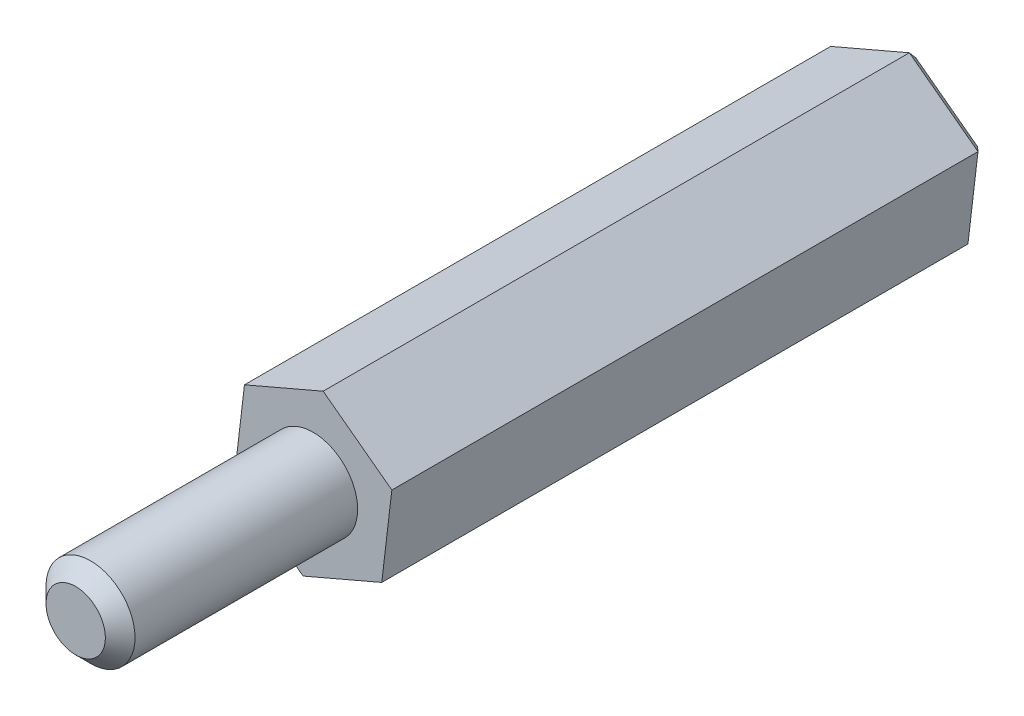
ISO-10303-21;
HEADER;
FILE_DESCRIPTION(('STEP AP214'),'2;1');
FILE_NAME('part.step','',(''),(''),'','','');
FILE_SCHEMA(('AUTOMOTIVE_DESIGN { 1 0 10303 214 1 1 1 1 }'));
ENDSEC;
DATA;
#1=APPLICATION_CONTEXT('core data for automotive mechanical design processes');
#2=APPLICATION_PROTOCOL_DEFINITION('international standard','automotive_design',2000,#1);
#3=PRODUCT_CONTEXT('',#1,'mechanical');
#4=PRODUCT('Part','Part','',(#3));
#5=PRODUCT_RELATED_PRODUCT_CATEGORY('part','',(#4));
#6=PRODUCT_DEFINITION_FORMATION('','',#4);
#7=PRODUCT_DEFINITION_CONTEXT('part definition',#1,'design');
#8=PRODUCT_DEFINITION('design','',#6,#7);
#9=PRODUCT_DEFINITION_SHAPE('','',#8);
#10=(LENGTH_UNIT() NAMED_UNIT(*) SI_UNIT(.MILLI.,.METRE.));
#11=(NAMED_UNIT(*) PLANE_ANGLE_UNIT() SI_UNIT($,.RADIAN.));
#12=(NAMED_UNIT(*) SI_UNIT($,.STERADIAN.) SOLID_ANGLE_UNIT());
#13=UNCERTAINTY_MEASURE_WITH_UNIT(LENGTH_MEASURE(1.E-05),#10,'distance_accuracy_value','');
#14=(GEOMETRIC_REPRESENTATION_CONTEXT(3) GLOBAL_UNCERTAINTY_ASSIGNED_CONTEXT((#13)) GLOBAL_UNIT_ASSIGNED_CONTEXT((#10,
#11,#12)) REPRESENTATION_CONTEXT('',''));
#15=CARTESIAN_POINT('',(0.,0.,0.));
#16=DIRECTION('',(0.,0.,1.));
#17=DIRECTION('',(1.,0.,0.));
#18=AXIS2_PLACEMENT_3D('',#15,#16,#17);
#19=CARTESIAN_POINT('',(0.,0.,20.));
#20=DIRECTION('',(0.,0.,1.));
#21=DIRECTION('',(1.,0.,0.));
#22=AXIS2_PLACEMENT_3D('',#19,#20,#21);
#23=PLANE('',#22);
#24=DIRECTION('',(-0.117457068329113,-0.993077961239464,0.));
#25=VECTOR('',#24,1.);
#26=CARTESIAN_POINT('',(-2.31316022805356,1.7270272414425,20.));
#27=LINE('',#26,#25);
#28=CARTESIAN_POINT('',(-2.31316022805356,1.7270272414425,20.));
#29=VERTEX_POINT('',#28);
#30=CARTESIAN_POINT('',(-2.65222957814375,-1.13974189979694,20.));
#31=VERTEX_POINT('',#30);
#32=EDGE_CURVE('E119',#29,#31,#27,.T.);
#33=ORIENTED_EDGE('',*,*,#32,.T.);
#34=DIRECTION('',(0.801302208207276,-0.59825978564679,0.));
#35=VECTOR('',#34,1.);
#36=CARTESIAN_POINT('',(-2.65222957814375,-1.13974189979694,20.));
#37=LINE('',#36,#35);
#38=CARTESIAN_POINT('',(-0.339069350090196,-2.86676914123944,20.));
#39=VERTEX_POINT('',#38);
#40=EDGE_CURVE('E107',#31,#39,#37,.T.);
#41=ORIENTED_EDGE('',*,*,#40,.T.);
#42=DIRECTION('',(0.918759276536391,0.394818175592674,0.));
#43=VECTOR('',#42,1.);
#44=CARTESIAN_POINT('',(-0.339069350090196,-2.86676914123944,20.));
#45=LINE('',#44,#43);
#46=CARTESIAN_POINT('',(2.31316022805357,-1.7270272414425,20.));
#47=VERTEX_POINT('',#46);
#48=EDGE_CURVE('E118',#39,#47,#45,.T.);
#49=ORIENTED_EDGE('',*,*,#48,.T.);
#50=DIRECTION('',(0.117457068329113,0.993077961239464,0.));
#51=VECTOR('',#50,1.);
#52=CARTESIAN_POINT('',(2.31316022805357,-1.7270272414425,20.));
#53=LINE('',#52,#51);
#54=CARTESIAN_POINT('',(2.65222957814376,1.13974189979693,20.));
#55=VERTEX_POINT('',#54);
#56=EDGE_CURVE('E196',#47,#55,#53,.T.);
#57=ORIENTED_EDGE('',*,*,#56,.T.);
#58=DIRECTION('',(-0.801302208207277,0.598259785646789,0.));
#59=VECTOR('',#58,1.);
#60=CARTESIAN_POINT('',(2.65222957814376,1.13974189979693,20.));
#61=LINE('',#60,#59);
#62=CARTESIAN_POINT('',(0.339069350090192,2.86676914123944,20.));
#63=VERTEX_POINT('',#62);
#64=EDGE_CURVE('E198',#55,#63,#61,.T.);
#65=ORIENTED_EDGE('',*,*,#64,.T.);
#66=DIRECTION('',(-0.918759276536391,-0.394818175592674,0.));
#67=VECTOR('',#66,1.);
#68=CARTESIAN_POINT('',(0.339069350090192,2.86676914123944,20.));
#69=LINE('',#68,#67);
#70=EDGE_CURVE('E124',#63,#29,#69,.T.);
#71=ORIENTED_EDGE('',*,*,#70,.T.);
#72=EDGE_LOOP('',(#33,#41,#49,#57,#65,#71));
#73=FACE_BOUND('',#72,.T.);
#74=CARTESIAN_POINT('',(0.,0.,20.));
#75=DIRECTION('',(0.,0.,1.));
#76=DIRECTION('',(1.,0.,0.));
#77=AXIS2_PLACEMENT_3D('',#74,#75,#76);
#78=CIRCLE('',#77,1.5);
#79=CARTESIAN_POINT('',(1.5,0.,20.));
#80=VERTEX_POINT('',#79);
#81=EDGE_CURVE('E126',#80,#80,#78,.T.);
#82=ORIENTED_EDGE('',*,*,#81,.F.);
#83=EDGE_LOOP('',(#82));
#84=FACE_BOUND('',#83,.T.);
#85=ADVANCED_FACE('F33',(#73,#84),#23,.T.);
#86=CARTESIAN_POINT('',(-2.31316022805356,1.7270272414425,20.));
#87=DIRECTION('',(0.993077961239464,-0.117457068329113,0.));
#88=DIRECTION('',(0.117457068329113,0.993077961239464,0.));
#89=AXIS2_PLACEMENT_3D('',#86,#87,#88);
#90=PLANE('',#89);
#91=DIRECTION('',(0.,0.,-1.));
#92=VECTOR('',#91,1.);
#93=CARTESIAN_POINT('',(-2.31316022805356,1.7270272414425,20.));
#94=LINE('',#93,#92);
#95=CARTESIAN_POINT('',(-2.31316022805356,1.7270272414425,0.249999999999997));
#96=VERTEX_POINT('',#95);
#97=EDGE_CURVE('E201',#29,#96,#94,.T.);
#98=ORIENTED_EDGE('',*,*,#97,.T.);
#99=DIRECTION('',(-0.117457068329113,-0.993077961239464,0.));
#100=VECTOR('',#99,1.);
#101=CARTESIAN_POINT('',(-2.31316022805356,1.7270272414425,0.249999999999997));
#102=LINE('',#101,#100);
#103=CARTESIAN_POINT('',(-2.65222957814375,-1.13974189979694,0.249999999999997));
#104=VERTEX_POINT('',#103);
#105=EDGE_CURVE('E11',#96,#104,#102,.T.);
#106=ORIENTED_EDGE('',*,*,#105,.T.);
#107=DIRECTION('',(0.,0.,-1.));
#108=VECTOR('',#107,1.);
#109=CARTESIAN_POINT('',(-2.65222957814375,-1.13974189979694,20.));
#110=LINE('',#109,#108);
#111=EDGE_CURVE('E112',#31,#104,#110,.T.);
#112=ORIENTED_EDGE('',*,*,#111,.F.);
#113=ORIENTED_EDGE('',*,*,#32,.F.);
#114=EDGE_LOOP('',(#98,#106,#112,#113));
#115=FACE_BOUND('',#114,.T.);
#116=ADVANCED_FACE('F128',(#115),#90,.F.);
#117=CARTESIAN_POINT('',(-2.65222957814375,-1.13974189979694,20.));
#118=DIRECTION('',(0.59825978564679,0.801302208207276,0.));
#119=DIRECTION('',(-0.801302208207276,0.59825978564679,0.));
#120=AXIS2_PLACEMENT_3D('',#117,#118,#119);
#121=PLANE('',#120);
#122=ORIENTED_EDGE('',*,*,#111,.T.);
#123=DIRECTION('',(0.801302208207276,-0.59825978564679,0.));
#124=VECTOR('',#123,1.);
#125=CARTESIAN_POINT('',(-2.65222957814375,-1.13974189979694,0.249999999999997));
#126=LINE('',#125,#124);
#127=CARTESIAN_POINT('',(-0.339069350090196,-2.86676914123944,0.249999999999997));
#128=VERTEX_POINT('',#127);
#129=EDGE_CURVE('E147',#104,#128,#126,.T.);
#130=ORIENTED_EDGE('',*,*,#129,.T.);
#131=DIRECTION('',(0.,0.,-1.));
#132=VECTOR('',#131,1.);
#133=CARTESIAN_POINT('',(-0.339069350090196,-2.86676914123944,20.));
#134=LINE('',#133,#132);
#135=EDGE_CURVE('E115',#39,#128,#134,.T.);
#136=ORIENTED_EDGE('',*,*,#135,.F.);
#137=ORIENTED_EDGE('',*,*,#40,.F.);
#138=EDGE_LOOP('',(#122,#130,#136,#137));
#139=FACE_BOUND('',#138,.T.);
#140=ADVANCED_FACE('F109',(#139),#121,.F.);
#141=CARTESIAN_POINT('',(-0.339069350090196,-2.86676914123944,20.));
#142=DIRECTION('',(-0.394818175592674,0.918759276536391,0.));
#143=DIRECTION('',(-0.918759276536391,-0.394818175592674,0.));
#144=AXIS2_PLACEMENT_3D('',#141,#142,#143);
#145=PLANE('',#144);
#146=ORIENTED_EDGE('',*,*,#135,.T.);
#147=DIRECTION('',(0.918759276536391,0.394818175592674,0.));
#148=VECTOR('',#147,1.);
#149=CARTESIAN_POINT('',(-0.339069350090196,-2.86676914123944,0.249999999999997));
#150=LINE('',#149,#148);
#151=CARTESIAN_POINT('',(2.31316022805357,-1.7270272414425,0.249999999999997));
#152=VERTEX_POINT('',#151);
#153=EDGE_CURVE('E162',#128,#152,#150,.T.);
#154=ORIENTED_EDGE('',*,*,#153,.T.);
#155=DIRECTION('',(0.,0.,-1.));
#156=VECTOR('',#155,1.);
#157=CARTESIAN_POINT('',(2.31316022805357,-1.7270272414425,20.));
#158=LINE('',#157,#156);
#159=EDGE_CURVE('E135',#47,#152,#158,.T.);
#160=ORIENTED_EDGE('',*,*,#159,.F.);
#161=ORIENTED_EDGE('',*,*,#48,.F.);
#162=EDGE_LOOP('',(#146,#154,#160,#161));
#163=FACE_BOUND('',#162,.T.);
#164=ADVANCED_FACE('F261',(#163),#145,.F.);
#165=CARTESIAN_POINT('',(2.31316022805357,-1.7270272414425,20.));
#166=DIRECTION('',(-0.993077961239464,0.117457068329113,0.));
#167=DIRECTION('',(-0.117457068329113,-0.993077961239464,0.));
#168=AXIS2_PLACEMENT_3D('',#165,#166,#167);
#169=PLANE('',#168);
#170=ORIENTED_EDGE('',*,*,#159,.T.);
#171=DIRECTION('',(0.117457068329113,0.993077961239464,0.));
#172=VECTOR('',#171,1.);
#173=CARTESIAN_POINT('',(2.31316022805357,-1.7270272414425,0.249999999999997));
#174=LINE('',#173,#172);
#175=CARTESIAN_POINT('',(2.65222957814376,1.13974189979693,0.249999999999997));
#176=VERTEX_POINT('',#175);
#177=EDGE_CURVE('E164',#152,#176,#174,.T.);
#178=ORIENTED_EDGE('',*,*,#177,.T.);
#179=DIRECTION('',(0.,0.,-1.));
#180=VECTOR('',#179,1.);
#181=CARTESIAN_POINT('',(2.65222957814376,1.13974189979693,20.));
#182=LINE('',#181,#180);
#183=EDGE_CURVE('E205',#55,#176,#182,.T.);
#184=ORIENTED_EDGE('',*,*,#183,.F.);
#185=ORIENTED_EDGE('',*,*,#56,.F.);
#186=EDGE_LOOP('',(#170,#178,#184,#185));
#187=FACE_BOUND('',#186,.T.);
#188=ADVANCED_FACE('F210',(#187),#169,.F.);
#189=CARTESIAN_POINT('',(2.65222957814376,1.13974189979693,20.));
#190=DIRECTION('',(-0.598259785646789,-0.801302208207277,0.));
#191=DIRECTION('',(0.801302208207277,-0.598259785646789,0.));
#192=AXIS2_PLACEMENT_3D('',#189,#190,#191);
#193=PLANE('',#192);
#194=ORIENTED_EDGE('',*,*,#183,.T.);
#195=DIRECTION('',(-0.801302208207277,0.598259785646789,0.));
#196=VECTOR('',#195,1.);
#197=CARTESIAN_POINT('',(2.65222957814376,1.13974189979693,0.249999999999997));
#198=LINE('',#197,#196);
#199=CARTESIAN_POINT('',(0.339069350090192,2.86676914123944,0.249999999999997));
#200=VERTEX_POINT('',#199);
#201=EDGE_CURVE('E57',#176,#200,#198,.T.);
#202=ORIENTED_EDGE('',*,*,#201,.T.);
#203=DIRECTION('',(0.,0.,-1.));
#204=VECTOR('',#203,1.);
#205=CARTESIAN_POINT('',(0.339069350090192,2.86676914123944,20.));
#206=LINE('',#205,#204);
#207=EDGE_CURVE('E203',#63,#200,#206,.T.);
#208=ORIENTED_EDGE('',*,*,#207,.F.);
#209=ORIENTED_EDGE('',*,*,#64,.F.);
#210=EDGE_LOOP('',(#194,#202,#208,#209));
#211=FACE_BOUND('',#210,.T.);
#212=ADVANCED_FACE('F256',(#211),#193,.F.);
#213=CARTESIAN_POINT('',(0.339069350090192,2.86676914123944,20.));
#214=DIRECTION('',(0.394818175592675,-0.918759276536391,0.));
#215=DIRECTION('',(0.918759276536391,0.394818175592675,0.));
#216=AXIS2_PLACEMENT_3D('',#213,#214,#215);
#217=PLANE('',#216);
#218=ORIENTED_EDGE('',*,*,#207,.T.);
#219=DIRECTION('',(-0.918759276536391,-0.394818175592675,0.));
#220=VECTOR('',#219,1.);
#221=CARTESIAN_POINT('',(0.339069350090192,2.86676914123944,0.249999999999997));
#222=LINE('',#221,#220);
#223=EDGE_CURVE('E42',#200,#96,#222,.T.);
#224=ORIENTED_EDGE('',*,*,#223,.T.);
#225=ORIENTED_EDGE('',*,*,#97,.F.);
#226=ORIENTED_EDGE('',*,*,#70,.F.);
#227=EDGE_LOOP('',(#218,#224,#225,#226));
#228=FACE_BOUND('',#227,.T.);
#229=ADVANCED_FACE('F253',(#228),#217,.F.);
#230=CARTESIAN_POINT('',(0.,0.,0.));
#231=DIRECTION('',(0.,0.,1.));
#232=DIRECTION('',(1.,0.,0.));
#233=AXIS2_PLACEMENT_3D('',#230,#231,#232);
#234=PLANE('',#233);
#235=DIRECTION('',(-0.918759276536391,-0.394818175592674,0.));
#236=VECTOR('',#235,1.);
#237=CARTESIAN_POINT('',(0.888340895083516,-2.06720837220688,0.));
#238=LINE('',#237,#236);
#239=CARTESIAN_POINT('',(2.08184420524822,-1.55432451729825,0.));
#240=VERTEX_POINT('',#239);
#241=CARTESIAN_POINT('',(-0.305162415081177,-2.5800922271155,0.));
#242=VERTEX_POINT('',#241);
#243=EDGE_CURVE('E157',#240,#242,#238,.T.);
#244=ORIENTED_EDGE('',*,*,#243,.T.);
#245=DIRECTION('',(-0.801302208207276,0.59825978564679,0.));
#246=VECTOR('',#245,1.);
#247=CARTESIAN_POINT('',(-1.34608451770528,-1.80292996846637,0.));
#248=LINE('',#247,#246);
#249=CARTESIAN_POINT('',(-2.38700662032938,-1.02576770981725,0.));
#250=VERTEX_POINT('',#249);
#251=EDGE_CURVE('E159',#242,#250,#248,.T.);
#252=ORIENTED_EDGE('',*,*,#251,.T.);
#253=DIRECTION('',(0.117457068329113,0.993077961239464,0.));
#254=VECTOR('',#253,1.);
#255=CARTESIAN_POINT('',(-2.23442541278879,0.264278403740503,0.));
#256=LINE('',#255,#254);
#257=CARTESIAN_POINT('',(-2.08184420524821,1.55432451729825,0.));
#258=VERTEX_POINT('',#257);
#259=EDGE_CURVE('E149',#250,#258,#256,.T.);
#260=ORIENTED_EDGE('',*,*,#259,.T.);
#261=DIRECTION('',(0.918759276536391,0.394818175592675,0.));
#262=VECTOR('',#261,1.);
#263=CARTESIAN_POINT('',(-0.888340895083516,2.06720837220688,0.));
#264=LINE('',#263,#262);
#265=CARTESIAN_POINT('',(0.305162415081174,2.5800922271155,0.));
#266=VERTEX_POINT('',#265);
#267=EDGE_CURVE('E151',#258,#266,#264,.T.);
#268=ORIENTED_EDGE('',*,*,#267,.T.);
#269=DIRECTION('',(0.801302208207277,-0.598259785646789,0.));
#270=VECTOR('',#269,1.);
#271=CARTESIAN_POINT('',(1.34608451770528,1.80292996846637,0.));
#272=LINE('',#271,#270);
#273=CARTESIAN_POINT('',(2.38700662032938,1.02576770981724,0.));
#274=VERTEX_POINT('',#273);
#275=EDGE_CURVE('E153',#266,#274,#272,.T.);
#276=ORIENTED_EDGE('',*,*,#275,.T.);
#277=DIRECTION('',(-0.117457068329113,-0.993077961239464,0.));
#278=VECTOR('',#277,1.);
#279=CARTESIAN_POINT('',(2.2344254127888,-0.264278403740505,0.));
#280=LINE('',#279,#278);
#281=EDGE_CURVE('E155',#274,#240,#280,.T.);
#282=ORIENTED_EDGE('',*,*,#281,.T.);
#283=EDGE_LOOP('',(#244,#252,#260,#268,#276,#282));
#284=FACE_BOUND('',#283,.T.);
#285=CARTESIAN_POINT('',(0.,0.,0.));
#286=DIRECTION('',(0.,0.,1.));
#287=DIRECTION('',(1.,0.,0.));
#288=AXIS2_PLACEMENT_3D('',#285,#286,#287);
#289=CIRCLE('',#288,2.00000000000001);
#290=CARTESIAN_POINT('',(2.00000000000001,0.,0.));
#291=VERTEX_POINT('',#290);
#292=EDGE_CURVE('E144',#291,#291,#289,.T.);
#293=ORIENTED_EDGE('',*,*,#292,.T.);
#294=EDGE_LOOP('',(#293));
#295=FACE_BOUND('',#294,.T.);
#296=ADVANCED_FACE('F222',(#284,#295),#234,.F.);
#297=CARTESIAN_POINT('',(0.,0.,28.));
#298=DIRECTION('',(0.,0.,-1.));
#299=DIRECTION('',(-1.,0.,0.));
#300=AXIS2_PLACEMENT_3D('',#297,#298,#299);
#301=CYLINDRICAL_SURFACE('',#300,1.5);
#302=CARTESIAN_POINT('',(0.,0.,27.5));
#303=DIRECTION('',(0.,0.,1.));
#304=DIRECTION('',(1.,0.,0.));
#305=AXIS2_PLACEMENT_3D('',#302,#303,#304);
#306=CIRCLE('',#305,1.5);
#307=CARTESIAN_POINT('',(1.5,0.,27.5));
#308=VERTEX_POINT('',#307);
#309=EDGE_CURVE('E133',#308,#308,#306,.F.);
#310=ORIENTED_EDGE('',*,*,#309,.T.);
#311=EDGE_LOOP('',(#310));
#312=FACE_BOUND('',#311,.T.);
#313=ORIENTED_EDGE('',*,*,#81,.T.);
#314=EDGE_LOOP('',(#313));
#315=FACE_BOUND('',#314,.T.);
#316=ADVANCED_FACE('F249',(#312,#315),#301,.T.);
#317=CARTESIAN_POINT('',(0.,0.,28.));
#318=DIRECTION('',(0.,0.,1.));
#319=DIRECTION('',(1.,0.,0.));
#320=AXIS2_PLACEMENT_3D('',#317,#318,#319);
#321=PLANE('',#320);
#322=CARTESIAN_POINT('',(0.,0.,28.));
#323=DIRECTION('',(0.,0.,1.));
#324=DIRECTION('',(1.,0.,0.));
#325=AXIS2_PLACEMENT_3D('',#322,#323,#324);
#326=CIRCLE('',#325,1.);
#327=CARTESIAN_POINT('',(1.,0.,28.));
#328=VERTEX_POINT('',#327);
#329=EDGE_CURVE('E130',#328,#328,#326,.T.);
#330=ORIENTED_EDGE('',*,*,#329,.T.);
#331=EDGE_LOOP('',(#330));
#332=FACE_BOUND('',#331,.T.);
#333=ADVANCED_FACE('F270',(#332),#321,.T.);
#334=CARTESIAN_POINT('',(0.,0.,28.));
#335=DIRECTION('',(0.,0.,-1.));
#336=DIRECTION('',(-1.,0.,0.));
#337=AXIS2_PLACEMENT_3D('',#334,#335,#336);
#338=CONICAL_SURFACE('',#337,1.,0.785398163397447);
#339=ORIENTED_EDGE('',*,*,#309,.F.);
#340=EDGE_LOOP('',(#339));
#341=FACE_BOUND('',#340,.T.);
#342=ORIENTED_EDGE('',*,*,#329,.F.);
#343=EDGE_LOOP('',(#342));
#344=FACE_BOUND('',#343,.T.);
#345=ADVANCED_FACE('F266',(#341,#344),#338,.T.);
#346=CARTESIAN_POINT('',(0.,0.,10.));
#347=DIRECTION('',(0.,0.,-1.));
#348=DIRECTION('',(-1.,0.,0.));
#349=AXIS2_PLACEMENT_3D('',#346,#347,#348);
#350=CYLINDRICAL_SURFACE('',#349,1.5);
#351=CARTESIAN_POINT('',(0.,0.,0.500000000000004));
#352=DIRECTION('',(0.,0.,1.));
#353=DIRECTION('',(1.,0.,0.));
#354=AXIS2_PLACEMENT_3D('',#351,#352,#353);
#355=CIRCLE('',#354,1.5);
#356=CARTESIAN_POINT('',(1.5,0.,0.500000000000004));
#357=VERTEX_POINT('',#356);
#358=EDGE_CURVE('E141',#357,#357,#355,.F.);
#359=ORIENTED_EDGE('',*,*,#358,.T.);
#360=EDGE_LOOP('',(#359));
#361=FACE_BOUND('',#360,.T.);
#362=CARTESIAN_POINT('',(0.,0.,10.));
#363=DIRECTION('',(0.,0.,-1.));
#364=DIRECTION('',(-1.,0.,0.));
#365=AXIS2_PLACEMENT_3D('',#362,#363,#364);
#366=CIRCLE('',#365,1.5);
#367=CARTESIAN_POINT('',(-1.5,0.,10.));
#368=VERTEX_POINT('',#367);
#369=EDGE_CURVE('E184',#368,#368,#366,.T.);
#370=ORIENTED_EDGE('',*,*,#369,.F.);
#371=EDGE_LOOP('',(#370));
#372=FACE_BOUND('',#371,.T.);
#373=ADVANCED_FACE('F269',(#361,#372),#350,.F.);
#374=CARTESIAN_POINT('',(0.,0.,10.));
#375=DIRECTION('',(0.,0.,-1.));
#376=DIRECTION('',(-1.,0.,0.));
#377=AXIS2_PLACEMENT_3D('',#374,#375,#376);
#378=PLANE('',#377);
#379=ORIENTED_EDGE('',*,*,#369,.T.);
#380=EDGE_LOOP('',(#379));
#381=FACE_BOUND('',#380,.T.);
#382=ADVANCED_FACE('F274',(#381),#378,.T.);
#383=CARTESIAN_POINT('',(0.,0.,0.500000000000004));
#384=DIRECTION('',(0.,0.,-1.));
#385=DIRECTION('',(-1.,0.,0.));
#386=AXIS2_PLACEMENT_3D('',#383,#384,#385);
#387=CONICAL_SURFACE('',#386,1.5,0.785398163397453);
#388=ORIENTED_EDGE('',*,*,#292,.F.);
#389=EDGE_LOOP('',(#388));
#390=FACE_BOUND('',#389,.T.);
#391=ORIENTED_EDGE('',*,*,#358,.F.);
#392=EDGE_LOOP('',(#391));
#393=FACE_BOUND('',#392,.T.);
#394=ADVANCED_FACE('F239',(#390,#393),#387,.F.);
#395=CARTESIAN_POINT('',(2.65222957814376,1.13974189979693,0.249999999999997));
#396=DIRECTION('',(-0.423033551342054,-0.566606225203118,0.70710678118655));
#397=DIRECTION('',(-0.801302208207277,0.598259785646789,0.));
#398=AXIS2_PLACEMENT_3D('',#395,#396,#397);
#399=PLANE('',#398);
#400=DIRECTION('',(-0.694516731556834,-0.298454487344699,-0.654653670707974));
#401=VECTOR('',#400,1.);
#402=CARTESIAN_POINT('',(2.65222957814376,1.13974189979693,0.249999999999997));
#403=LINE('',#402,#401);
#404=EDGE_CURVE('E177',#274,#176,#403,.F.);
#405=ORIENTED_EDGE('',*,*,#404,.F.);
#406=ORIENTED_EDGE('',*,*,#275,.F.);
#407=DIRECTION('',(-0.0887891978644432,-0.750696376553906,-0.654653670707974));
#408=VECTOR('',#407,1.);
#409=CARTESIAN_POINT('',(0.339069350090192,2.86676914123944,0.249999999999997));
#410=LINE('',#409,#408);
#411=EDGE_CURVE('E37',#200,#266,#410,.T.);
#412=ORIENTED_EDGE('',*,*,#411,.F.);
#413=ORIENTED_EDGE('',*,*,#201,.F.);
#414=EDGE_LOOP('',(#405,#406,#412,#413));
#415=FACE_BOUND('',#414,.T.);
#416=ADVANCED_FACE('F35',(#415),#399,.F.);
#417=CARTESIAN_POINT('',(0.339069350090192,2.86676914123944,0.249999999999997));
#418=DIRECTION('',(0.27917860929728,-0.649660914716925,0.707106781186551));
#419=DIRECTION('',(-0.918759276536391,-0.394818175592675,0.));
#420=AXIS2_PLACEMENT_3D('',#417,#418,#419);
#421=PLANE('',#420);
#422=ORIENTED_EDGE('',*,*,#411,.T.);
#423=ORIENTED_EDGE('',*,*,#267,.F.);
#424=DIRECTION('',(0.605727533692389,-0.452241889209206,-0.654653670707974));
#425=VECTOR('',#424,1.);
#426=CARTESIAN_POINT('',(-2.31316022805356,1.7270272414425,0.249999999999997));
#427=LINE('',#426,#425);
#428=EDGE_CURVE('E175',#96,#258,#427,.T.);
#429=ORIENTED_EDGE('',*,*,#428,.F.);
#430=ORIENTED_EDGE('',*,*,#223,.F.);
#431=EDGE_LOOP('',(#422,#423,#429,#430));
#432=FACE_BOUND('',#431,.T.);
#433=ADVANCED_FACE('F232',(#432),#421,.F.);
#434=CARTESIAN_POINT('',(2.31316022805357,-1.7270272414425,0.249999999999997));
#435=DIRECTION('',(-0.702212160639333,0.0830546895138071,0.707106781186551));
#436=DIRECTION('',(0.117457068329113,0.993077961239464,0.));
#437=AXIS2_PLACEMENT_3D('',#434,#435,#436);
#438=PLANE('',#437);
#439=ORIENTED_EDGE('',*,*,#404,.T.);
#440=ORIENTED_EDGE('',*,*,#177,.F.);
#441=DIRECTION('',(-0.60572753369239,0.452241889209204,-0.654653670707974));
#442=VECTOR('',#441,1.);
#443=CARTESIAN_POINT('',(2.31316022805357,-1.7270272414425,0.249999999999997));
#444=LINE('',#443,#442);
#445=EDGE_CURVE('E172',#240,#152,#444,.F.);
#446=ORIENTED_EDGE('',*,*,#445,.F.);
#447=ORIENTED_EDGE('',*,*,#281,.F.);
#448=EDGE_LOOP('',(#439,#440,#446,#447));
#449=FACE_BOUND('',#448,.T.);
#450=ADVANCED_FACE('F214',(#449),#438,.F.);
#451=CARTESIAN_POINT('',(-2.31316022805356,1.7270272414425,0.249999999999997));
#452=DIRECTION('',(0.702212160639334,-0.0830546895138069,0.70710678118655));
#453=DIRECTION('',(-0.117457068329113,-0.993077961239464,0.));
#454=AXIS2_PLACEMENT_3D('',#451,#452,#453);
#455=PLANE('',#454);
#456=ORIENTED_EDGE('',*,*,#428,.T.);
#457=ORIENTED_EDGE('',*,*,#259,.F.);
#458=DIRECTION('',(-0.694516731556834,-0.2984544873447,0.654653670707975));
#459=VECTOR('',#458,1.);
#460=CARTESIAN_POINT('',(-1.89444969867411,-0.814101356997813,-0.464285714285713));
#461=LINE('',#460,#459);
#462=EDGE_CURVE('E170',#104,#250,#461,.F.);
#463=ORIENTED_EDGE('',*,*,#462,.F.);
#464=ORIENTED_EDGE('',*,*,#105,.F.);
#465=EDGE_LOOP('',(#456,#457,#463,#464));
#466=FACE_BOUND('',#465,.T.);
#467=ADVANCED_FACE('F229',(#466),#455,.F.);
#468=CARTESIAN_POINT('',(-0.339069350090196,-2.86676914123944,0.249999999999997));
#469=DIRECTION('',(-0.27917860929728,0.649660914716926,0.70710678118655));
#470=DIRECTION('',(0.918759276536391,0.394818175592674,0.));
#471=AXIS2_PLACEMENT_3D('',#468,#469,#470);
#472=PLANE('',#471);
#473=ORIENTED_EDGE('',*,*,#445,.T.);
#474=ORIENTED_EDGE('',*,*,#153,.F.);
#475=DIRECTION('',(0.0887891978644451,0.750696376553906,-0.654653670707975));
#476=VECTOR('',#475,1.);
#477=CARTESIAN_POINT('',(-0.339069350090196,-2.86676914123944,0.249999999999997));
#478=LINE('',#477,#476);
#479=EDGE_CURVE('E168',#242,#128,#478,.F.);
#480=ORIENTED_EDGE('',*,*,#479,.F.);
#481=ORIENTED_EDGE('',*,*,#243,.F.);
#482=EDGE_LOOP('',(#473,#474,#480,#481));
#483=FACE_BOUND('',#482,.T.);
#484=ADVANCED_FACE('F218',(#483),#472,.F.);
#485=CARTESIAN_POINT('',(-2.65222957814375,-1.13974189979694,0.249999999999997));
#486=DIRECTION('',(0.423033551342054,0.566606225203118,0.70710678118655));
#487=DIRECTION('',(0.801302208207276,-0.59825978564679,0.));
#488=AXIS2_PLACEMENT_3D('',#485,#486,#487);
#489=PLANE('',#488);
#490=ORIENTED_EDGE('',*,*,#462,.T.);
#491=ORIENTED_EDGE('',*,*,#251,.F.);
#492=ORIENTED_EDGE('',*,*,#479,.T.);
#493=ORIENTED_EDGE('',*,*,#129,.F.);
#494=EDGE_LOOP('',(#490,#491,#492,#493));
#495=FACE_BOUND('',#494,.T.);
#496=ADVANCED_FACE('F225',(#495),#489,.F.);
#497=CLOSED_SHELL('',(#85,#116,#140,#164,#188,#212,#229,#296,#316,#333,#345,#373,#382,#394,#416,
#433,#450,#467,#484,#496));
#498=MANIFOLD_SOLID_BREP('B2',#497);
#499=ADVANCED_BREP_SHAPE_REPRESENTATION('',(#18,#498),#14);
#500=SHAPE_DEFINITION_REPRESENTATION(#9,#499);
ENDSEC;
END-ISO-10303-21;
